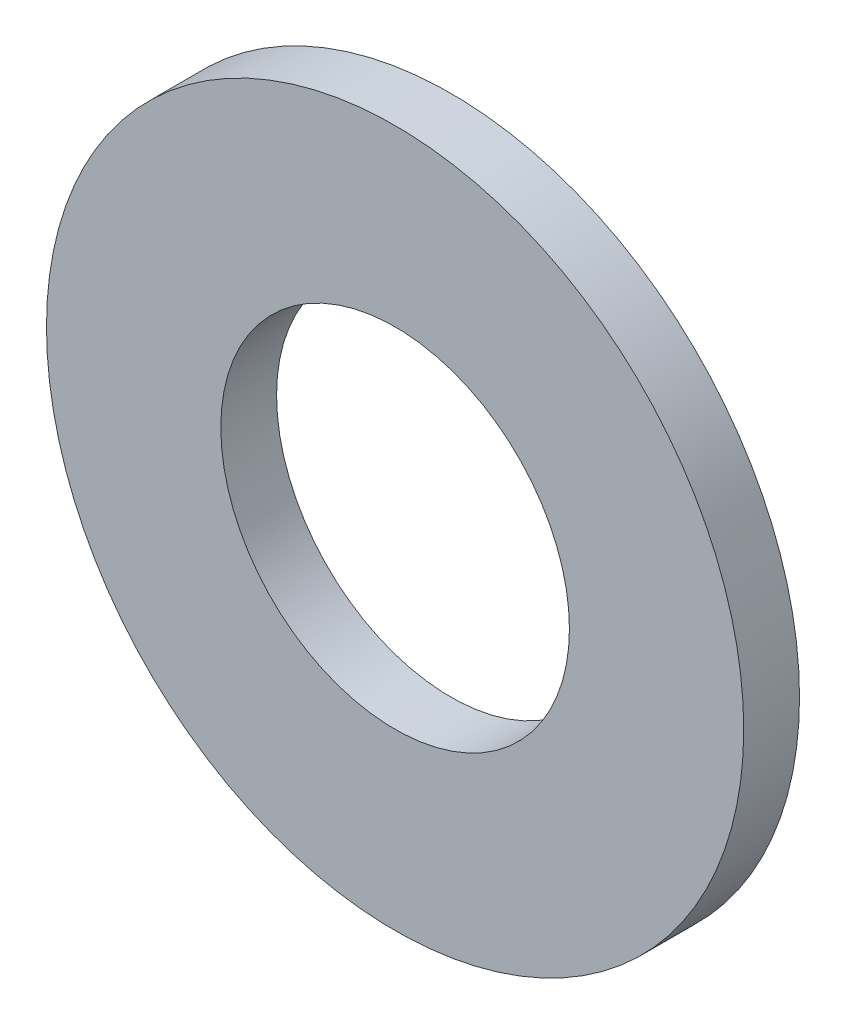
from build123d import *

# Parameters (mm, degrees)
ESQUISSE1_R          = 5
ESQUISSE1_R_2        = 2.5
BASE_EXTRUSION_DEPTH = 0.8


with BuildPart() as part:
    # Esquisse1 → Base-Extrusion (new body)
    with BuildSketch(Plane(origin=(0, 0, -0.8), x_dir=(-1, 0, 0), z_dir=(0, 0, -1))):
        with Locations(Location((0, 0, 0), (0, 0, 180))):
            Circle(ESQUISSE1_R)
        with Locations(Location((0, 0, 0), (0, 0, 180))):
            Circle(ESQUISSE1_R_2, mode=Mode.SUBTRACT)
    extrude(amount=-BASE_EXTRUSION_DEPTH)


solid = part.part
